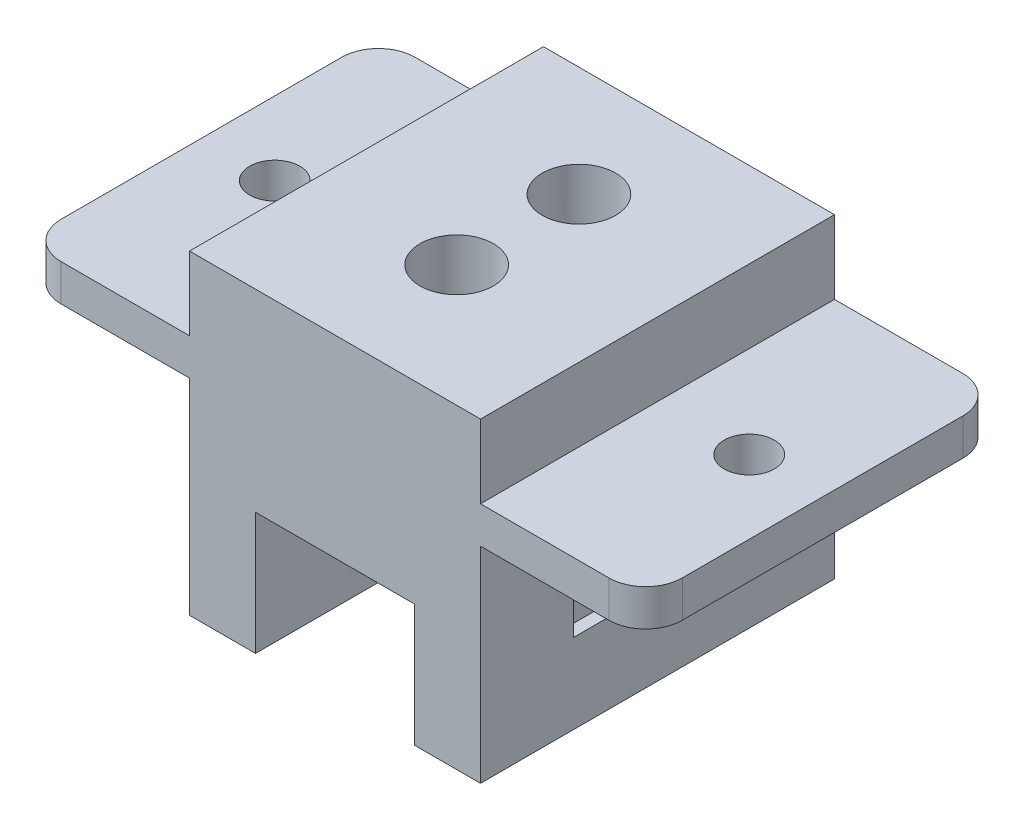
ISO-10303-21;
HEADER;
FILE_DESCRIPTION(('STEP AP214'),'2;1');
FILE_NAME('part.step','',(''),(''),'','','');
FILE_SCHEMA(('AUTOMOTIVE_DESIGN { 1 0 10303 214 1 1 1 1 }'));
ENDSEC;
DATA;
#1=APPLICATION_CONTEXT('core data for automotive mechanical design processes');
#2=APPLICATION_PROTOCOL_DEFINITION('international standard','automotive_design',2000,#1);
#3=PRODUCT_CONTEXT('',#1,'mechanical');
#4=PRODUCT('Part','Part','',(#3));
#5=PRODUCT_RELATED_PRODUCT_CATEGORY('part','',(#4));
#6=PRODUCT_DEFINITION_FORMATION('','',#4);
#7=PRODUCT_DEFINITION_CONTEXT('part definition',#1,'design');
#8=PRODUCT_DEFINITION('design','',#6,#7);
#9=PRODUCT_DEFINITION_SHAPE('','',#8);
#10=(LENGTH_UNIT() NAMED_UNIT(*) SI_UNIT(.MILLI.,.METRE.));
#11=(NAMED_UNIT(*) PLANE_ANGLE_UNIT() SI_UNIT($,.RADIAN.));
#12=(NAMED_UNIT(*) SI_UNIT($,.STERADIAN.) SOLID_ANGLE_UNIT());
#13=UNCERTAINTY_MEASURE_WITH_UNIT(LENGTH_MEASURE(1.E-05),#10,'distance_accuracy_value','');
#14=(GEOMETRIC_REPRESENTATION_CONTEXT(3) GLOBAL_UNCERTAINTY_ASSIGNED_CONTEXT((#13)) GLOBAL_UNIT_ASSIGNED_CONTEXT((#10,
#11,#12)) REPRESENTATION_CONTEXT('',''));
#15=CARTESIAN_POINT('',(0.,0.,0.));
#16=DIRECTION('',(0.,0.,1.));
#17=DIRECTION('',(1.,0.,0.));
#18=AXIS2_PLACEMENT_3D('',#15,#16,#17);
#19=CARTESIAN_POINT('',(23.8,25.8,28.95));
#20=DIRECTION('',(1.,0.,0.));
#21=DIRECTION('',(0.,0.,-1.));
#22=AXIS2_PLACEMENT_3D('',#19,#20,#21);
#23=PLANE('',#22);
#24=DIRECTION('',(0.,-1.,0.));
#25=VECTOR('',#24,1.);
#26=CARTESIAN_POINT('',(23.8,25.8,0.));
#27=LINE('',#26,#25);
#28=CARTESIAN_POINT('',(23.8,16.8,0.));
#29=VERTEX_POINT('',#28);
#30=CARTESIAN_POINT('',(23.8,0.,0.));
#31=VERTEX_POINT('',#30);
#32=EDGE_CURVE('E522',#29,#31,#27,.T.);
#33=ORIENTED_EDGE('',*,*,#32,.F.);
#34=DIRECTION('',(0.,0.,1.));
#35=VECTOR('',#34,1.);
#36=CARTESIAN_POINT('',(23.8,16.8,0.));
#37=LINE('',#36,#35);
#38=CARTESIAN_POINT('',(23.8,16.8,28.95));
#39=VERTEX_POINT('',#38);
#40=EDGE_CURVE('E466',#29,#39,#37,.T.);
#41=ORIENTED_EDGE('',*,*,#40,.T.);
#42=DIRECTION('',(0.,-1.,0.));
#43=VECTOR('',#42,1.);
#44=CARTESIAN_POINT('',(23.8,25.8,28.95));
#45=LINE('',#44,#43);
#46=CARTESIAN_POINT('',(23.8,0.,28.95));
#47=VERTEX_POINT('',#46);
#48=EDGE_CURVE('E497',#39,#47,#45,.T.);
#49=ORIENTED_EDGE('',*,*,#48,.T.);
#50=DIRECTION('',(0.,0.,-1.));
#51=VECTOR('',#50,1.);
#52=CARTESIAN_POINT('',(23.8,0.,28.95));
#53=LINE('',#52,#51);
#54=EDGE_CURVE('E548',#47,#31,#53,.T.);
#55=ORIENTED_EDGE('',*,*,#54,.T.);
#56=EDGE_LOOP('',(#33,#41,#49,#55));
#57=FACE_BOUND('',#56,.T.);
#58=DIRECTION('',(0.,0.,1.));
#59=VECTOR('',#58,1.);
#60=CARTESIAN_POINT('',(23.8,6.53013267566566,21.3382236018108));
#61=LINE('',#60,#59);
#62=CARTESIAN_POINT('',(23.8,6.53013267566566,11.4588520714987));
#63=VERTEX_POINT('',#62);
#64=CARTESIAN_POINT('',(23.8,6.53013267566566,21.3382236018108));
#65=VERTEX_POINT('',#64);
#66=EDGE_CURVE('E301',#63,#65,#61,.T.);
#67=ORIENTED_EDGE('',*,*,#66,.T.);
#68=DIRECTION('',(0.,1.,0.));
#69=VECTOR('',#68,1.);
#70=CARTESIAN_POINT('',(23.8,6.53013267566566,21.3382236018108));
#71=LINE('',#70,#69);
#72=CARTESIAN_POINT('',(23.8,11.9688428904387,21.3382236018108));
#73=VERTEX_POINT('',#72);
#74=EDGE_CURVE('E60',#65,#73,#71,.T.);
#75=ORIENTED_EDGE('',*,*,#74,.T.);
#76=DIRECTION('',(0.,0.,-1.));
#77=VECTOR('',#76,1.);
#78=CARTESIAN_POINT('',(23.8,11.9688428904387,21.3382236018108));
#79=LINE('',#78,#77);
#80=CARTESIAN_POINT('',(23.8,11.9688428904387,11.4588520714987));
#81=VERTEX_POINT('',#80);
#82=EDGE_CURVE('E286',#73,#81,#79,.T.);
#83=ORIENTED_EDGE('',*,*,#82,.T.);
#84=DIRECTION('',(0.,1.,0.));
#85=VECTOR('',#84,1.);
#86=CARTESIAN_POINT('',(23.8,11.9688428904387,11.4588520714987));
#87=LINE('',#86,#85);
#88=CARTESIAN_POINT('',(23.8,14.6008705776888,11.4588520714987));
#89=VERTEX_POINT('',#88);
#90=EDGE_CURVE('E289',#81,#89,#87,.T.);
#91=ORIENTED_EDGE('',*,*,#90,.T.);
#92=DIRECTION('',(0.,-0.757643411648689,-0.652668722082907));
#93=VECTOR('',#92,1.);
#94=CARTESIAN_POINT('',(23.8,14.6008705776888,11.4588520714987));
#95=LINE('',#94,#93);
#96=CARTESIAN_POINT('',(23.8,9.2494877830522,6.848925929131));
#97=VERTEX_POINT('',#96);
#98=EDGE_CURVE('E309',#89,#97,#95,.T.);
#99=ORIENTED_EDGE('',*,*,#98,.T.);
#100=DIRECTION('',(0.,-0.757643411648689,0.652668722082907));
#101=VECTOR('',#100,1.);
#102=CARTESIAN_POINT('',(23.8,9.2494877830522,6.848925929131));
#103=LINE('',#102,#101);
#104=CARTESIAN_POINT('',(23.8,3.89810498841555,11.4588520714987));
#105=VERTEX_POINT('',#104);
#106=EDGE_CURVE('E306',#97,#105,#103,.T.);
#107=ORIENTED_EDGE('',*,*,#106,.T.);
#108=DIRECTION('',(0.,1.,0.));
#109=VECTOR('',#108,1.);
#110=CARTESIAN_POINT('',(23.8,3.89810498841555,11.4588520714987));
#111=LINE('',#110,#109);
#112=EDGE_CURVE('E303',#105,#63,#111,.T.);
#113=ORIENTED_EDGE('',*,*,#112,.T.);
#114=EDGE_LOOP('',(#67,#75,#83,#91,#99,#107,#113));
#115=FACE_BOUND('',#114,.T.);
#116=ADVANCED_FACE('F43',(#57,#115),#23,.T.);
#117=CARTESIAN_POINT('',(0.,0.,28.95));
#118=DIRECTION('',(-1.,0.,0.));
#119=DIRECTION('',(0.,0.,1.));
#120=AXIS2_PLACEMENT_3D('',#117,#118,#119);
#121=PLANE('',#120);
#122=DIRECTION('',(0.,1.,0.));
#123=VECTOR('',#122,1.);
#124=CARTESIAN_POINT('',(0.,6.53013267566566,21.3382236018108));
#125=LINE('',#124,#123);
#126=CARTESIAN_POINT('',(0.,6.53013267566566,21.3382236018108));
#127=VERTEX_POINT('',#126);
#128=CARTESIAN_POINT('',(0.,11.9688428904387,21.3382236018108));
#129=VERTEX_POINT('',#128);
#130=EDGE_CURVE('E68',#127,#129,#125,.T.);
#131=ORIENTED_EDGE('',*,*,#130,.F.);
#132=DIRECTION('',(0.,0.,1.));
#133=VECTOR('',#132,1.);
#134=CARTESIAN_POINT('',(0.,6.53013267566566,21.3382236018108));
#135=LINE('',#134,#133);
#136=CARTESIAN_POINT('',(0.,6.53013267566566,11.4588520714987));
#137=VERTEX_POINT('',#136);
#138=EDGE_CURVE('E329',#137,#127,#135,.T.);
#139=ORIENTED_EDGE('',*,*,#138,.F.);
#140=DIRECTION('',(0.,1.,0.));
#141=VECTOR('',#140,1.);
#142=CARTESIAN_POINT('',(0.,3.89810498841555,11.4588520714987));
#143=LINE('',#142,#141);
#144=CARTESIAN_POINT('',(0.,3.89810498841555,11.4588520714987));
#145=VERTEX_POINT('',#144);
#146=EDGE_CURVE('E361',#145,#137,#143,.T.);
#147=ORIENTED_EDGE('',*,*,#146,.F.);
#148=DIRECTION('',(0.,-0.757643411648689,0.652668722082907));
#149=VECTOR('',#148,1.);
#150=CARTESIAN_POINT('',(0.,9.2494877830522,6.848925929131));
#151=LINE('',#150,#149);
#152=CARTESIAN_POINT('',(0.,9.2494877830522,6.848925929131));
#153=VERTEX_POINT('',#152);
#154=EDGE_CURVE('E358',#153,#145,#151,.T.);
#155=ORIENTED_EDGE('',*,*,#154,.F.);
#156=DIRECTION('',(0.,-0.757643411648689,-0.652668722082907));
#157=VECTOR('',#156,1.);
#158=CARTESIAN_POINT('',(0.,14.6008705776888,11.4588520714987));
#159=LINE('',#158,#157);
#160=CARTESIAN_POINT('',(0.,14.6008705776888,11.4588520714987));
#161=VERTEX_POINT('',#160);
#162=EDGE_CURVE('E355',#161,#153,#159,.T.);
#163=ORIENTED_EDGE('',*,*,#162,.F.);
#164=DIRECTION('',(0.,1.,0.));
#165=VECTOR('',#164,1.);
#166=CARTESIAN_POINT('',(0.,11.9688428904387,11.4588520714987));
#167=LINE('',#166,#165);
#168=CARTESIAN_POINT('',(0.,11.9688428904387,11.4588520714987));
#169=VERTEX_POINT('',#168);
#170=EDGE_CURVE('E352',#169,#161,#167,.T.);
#171=ORIENTED_EDGE('',*,*,#170,.F.);
#172=DIRECTION('',(0.,0.,-1.));
#173=VECTOR('',#172,1.);
#174=CARTESIAN_POINT('',(0.,11.9688428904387,21.3382236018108));
#175=LINE('',#174,#173);
#176=EDGE_CURVE('E349',#129,#169,#175,.T.);
#177=ORIENTED_EDGE('',*,*,#176,.F.);
#178=EDGE_LOOP('',(#131,#139,#147,#155,#163,#171,#177));
#179=FACE_BOUND('',#178,.T.);
#180=DIRECTION('',(0.,1.,0.));
#181=VECTOR('',#180,1.);
#182=CARTESIAN_POINT('',(0.,0.,28.95));
#183=LINE('',#182,#181);
#184=CARTESIAN_POINT('',(0.,0.,28.95));
#185=VERTEX_POINT('',#184);
#186=CARTESIAN_POINT('',(0.,16.8,28.95));
#187=VERTEX_POINT('',#186);
#188=EDGE_CURVE('E490',#185,#187,#183,.T.);
#189=ORIENTED_EDGE('',*,*,#188,.T.);
#190=DIRECTION('',(0.,0.,-1.));
#191=VECTOR('',#190,1.);
#192=CARTESIAN_POINT('',(0.,16.8,0.));
#193=LINE('',#192,#191);
#194=CARTESIAN_POINT('',(0.,16.8,0.));
#195=VERTEX_POINT('',#194);
#196=EDGE_CURVE('E388',#187,#195,#193,.T.);
#197=ORIENTED_EDGE('',*,*,#196,.T.);
#198=DIRECTION('',(0.,1.,0.));
#199=VECTOR('',#198,1.);
#200=CARTESIAN_POINT('',(0.,0.,0.));
#201=LINE('',#200,#199);
#202=CARTESIAN_POINT('',(0.,0.,0.));
#203=VERTEX_POINT('',#202);
#204=EDGE_CURVE('E516',#203,#195,#201,.T.);
#205=ORIENTED_EDGE('',*,*,#204,.F.);
#206=DIRECTION('',(0.,0.,-1.));
#207=VECTOR('',#206,1.);
#208=CARTESIAN_POINT('',(0.,0.,28.95));
#209=LINE('',#208,#207);
#210=EDGE_CURVE('E11',#185,#203,#209,.T.);
#211=ORIENTED_EDGE('',*,*,#210,.F.);
#212=EDGE_LOOP('',(#189,#197,#205,#211));
#213=FACE_BOUND('',#212,.T.);
#214=ADVANCED_FACE('F619',(#179,#213),#121,.T.);
#215=DIRECTION('',(0.,0.,-1.));
#216=VECTOR('',#215,1.);
#217=CARTESIAN_POINT('',(0.,19.8,0.));
#218=LINE('',#217,#216);
#219=CARTESIAN_POINT('',(0.,19.8,28.95));
#220=VERTEX_POINT('',#219);
#221=CARTESIAN_POINT('',(0.,19.8,0.));
#222=VERTEX_POINT('',#221);
#223=EDGE_CURVE('E383',#220,#222,#218,.T.);
#224=ORIENTED_EDGE('',*,*,#223,.F.);
#225=CARTESIAN_POINT('',(0.,25.8,28.95));
#226=VERTEX_POINT('',#225);
#227=EDGE_CURVE('E494',#220,#226,#183,.T.);
#228=ORIENTED_EDGE('',*,*,#227,.T.);
#229=DIRECTION('',(0.,0.,-1.));
#230=VECTOR('',#229,1.);
#231=CARTESIAN_POINT('',(0.,25.8,28.95));
#232=LINE('',#231,#230);
#233=CARTESIAN_POINT('',(0.,25.8,0.));
#234=VERTEX_POINT('',#233);
#235=EDGE_CURVE('E47',#226,#234,#232,.T.);
#236=ORIENTED_EDGE('',*,*,#235,.T.);
#237=EDGE_CURVE('E489',#222,#234,#201,.T.);
#238=ORIENTED_EDGE('',*,*,#237,.F.);
#239=EDGE_LOOP('',(#224,#228,#236,#238));
#240=FACE_BOUND('',#239,.T.);
#241=ADVANCED_FACE('F45',(#240),#121,.T.);
#242=CARTESIAN_POINT('',(5.4,0.,28.95));
#243=DIRECTION('',(0.,-1.,0.));
#244=DIRECTION('',(0.,0.,-1.));
#245=AXIS2_PLACEMENT_3D('',#242,#243,#244);
#246=PLANE('',#245);
#247=DIRECTION('',(-1.,0.,0.));
#248=VECTOR('',#247,1.);
#249=CARTESIAN_POINT('',(5.4,0.,0.));
#250=LINE('',#249,#248);
#251=CARTESIAN_POINT('',(5.4,0.,0.));
#252=VERTEX_POINT('',#251);
#253=EDGE_CURVE('E538',#252,#203,#250,.T.);
#254=ORIENTED_EDGE('',*,*,#253,.F.);
#255=DIRECTION('',(0.,0.,-1.));
#256=VECTOR('',#255,1.);
#257=CARTESIAN_POINT('',(5.4,0.,28.95));
#258=LINE('',#257,#256);
#259=CARTESIAN_POINT('',(5.4,0.,28.95));
#260=VERTEX_POINT('',#259);
#261=EDGE_CURVE('E52',#260,#252,#258,.T.);
#262=ORIENTED_EDGE('',*,*,#261,.F.);
#263=DIRECTION('',(-1.,0.,0.));
#264=VECTOR('',#263,1.);
#265=CARTESIAN_POINT('',(5.4,0.,28.95));
#266=LINE('',#265,#264);
#267=EDGE_CURVE('E513',#260,#185,#266,.T.);
#268=ORIENTED_EDGE('',*,*,#267,.T.);
#269=ORIENTED_EDGE('',*,*,#210,.T.);
#270=EDGE_LOOP('',(#254,#262,#268,#269));
#271=FACE_BOUND('',#270,.T.);
#272=ADVANCED_FACE('F615',(#271),#246,.T.);
#273=CARTESIAN_POINT('',(5.4,10.,28.95));
#274=DIRECTION('',(1.,0.,0.));
#275=DIRECTION('',(0.,0.,-1.));
#276=AXIS2_PLACEMENT_3D('',#273,#274,#275);
#277=PLANE('',#276);
#278=DIRECTION('',(0.,-1.,0.));
#279=VECTOR('',#278,1.);
#280=CARTESIAN_POINT('',(5.4,10.,0.));
#281=LINE('',#280,#279);
#282=CARTESIAN_POINT('',(5.4,10.,0.));
#283=VERTEX_POINT('',#282);
#284=EDGE_CURVE('E535',#283,#252,#281,.T.);
#285=ORIENTED_EDGE('',*,*,#284,.F.);
#286=DIRECTION('',(0.,0.,-1.));
#287=VECTOR('',#286,1.);
#288=CARTESIAN_POINT('',(5.4,10.,28.95));
#289=LINE('',#288,#287);
#290=CARTESIAN_POINT('',(5.4,10.,28.95));
#291=VERTEX_POINT('',#290);
#292=EDGE_CURVE('E542',#291,#283,#289,.T.);
#293=ORIENTED_EDGE('',*,*,#292,.F.);
#294=DIRECTION('',(0.,-1.,0.));
#295=VECTOR('',#294,1.);
#296=CARTESIAN_POINT('',(5.4,10.,28.95));
#297=LINE('',#296,#295);
#298=EDGE_CURVE('E510',#291,#260,#297,.T.);
#299=ORIENTED_EDGE('',*,*,#298,.T.);
#300=ORIENTED_EDGE('',*,*,#261,.T.);
#301=EDGE_LOOP('',(#285,#293,#299,#300));
#302=FACE_BOUND('',#301,.T.);
#303=ADVANCED_FACE('F612',(#302),#277,.T.);
#304=CARTESIAN_POINT('',(18.4,10.,28.95));
#305=DIRECTION('',(0.,-1.,0.));
#306=DIRECTION('',(0.,0.,-1.));
#307=AXIS2_PLACEMENT_3D('',#304,#305,#306);
#308=PLANE('',#307);
#309=CARTESIAN_POINT('',(11.9,10.,9.));
#310=DIRECTION('',(0.,-1.,0.));
#311=DIRECTION('',(0.,0.,-1.));
#312=AXIS2_PLACEMENT_3D('',#309,#310,#311);
#313=CIRCLE('',#312,3.);
#314=CARTESIAN_POINT('',(11.9,10.,6.));
#315=VERTEX_POINT('',#314);
#316=EDGE_CURVE('E486',#315,#315,#313,.T.);
#317=ORIENTED_EDGE('',*,*,#316,.F.);
#318=EDGE_LOOP('',(#317));
#319=FACE_BOUND('',#318,.T.);
#320=CARTESIAN_POINT('',(11.9,10.,19.));
#321=DIRECTION('',(0.,-1.,0.));
#322=DIRECTION('',(0.,0.,-1.));
#323=AXIS2_PLACEMENT_3D('',#320,#321,#322);
#324=CIRCLE('',#323,3.);
#325=CARTESIAN_POINT('',(11.9,10.,16.));
#326=VERTEX_POINT('',#325);
#327=EDGE_CURVE('E481',#326,#326,#324,.T.);
#328=ORIENTED_EDGE('',*,*,#327,.F.);
#329=EDGE_LOOP('',(#328));
#330=FACE_BOUND('',#329,.T.);
#331=DIRECTION('',(-1.,0.,0.));
#332=VECTOR('',#331,1.);
#333=CARTESIAN_POINT('',(18.4,10.,0.));
#334=LINE('',#333,#332);
#335=CARTESIAN_POINT('',(18.4,10.,0.));
#336=VERTEX_POINT('',#335);
#337=EDGE_CURVE('E532',#336,#283,#334,.T.);
#338=ORIENTED_EDGE('',*,*,#337,.F.);
#339=DIRECTION('',(0.,0.,-1.));
#340=VECTOR('',#339,1.);
#341=CARTESIAN_POINT('',(18.4,10.,28.95));
#342=LINE('',#341,#340);
#343=CARTESIAN_POINT('',(18.4,10.,28.95));
#344=VERTEX_POINT('',#343);
#345=EDGE_CURVE('E544',#344,#336,#342,.T.);
#346=ORIENTED_EDGE('',*,*,#345,.F.);
#347=DIRECTION('',(-1.,0.,0.));
#348=VECTOR('',#347,1.);
#349=CARTESIAN_POINT('',(18.4,10.,28.95));
#350=LINE('',#349,#348);
#351=EDGE_CURVE('E507',#344,#291,#350,.T.);
#352=ORIENTED_EDGE('',*,*,#351,.T.);
#353=ORIENTED_EDGE('',*,*,#292,.T.);
#354=EDGE_LOOP('',(#338,#346,#352,#353));
#355=FACE_BOUND('',#354,.T.);
#356=ADVANCED_FACE('F608',(#319,#330,#355),#308,.T.);
#357=CARTESIAN_POINT('',(18.4,0.,28.95));
#358=DIRECTION('',(-1.,0.,0.));
#359=DIRECTION('',(0.,0.,1.));
#360=AXIS2_PLACEMENT_3D('',#357,#358,#359);
#361=PLANE('',#360);
#362=DIRECTION('',(0.,1.,0.));
#363=VECTOR('',#362,1.);
#364=CARTESIAN_POINT('',(18.4,0.,0.));
#365=LINE('',#364,#363);
#366=CARTESIAN_POINT('',(18.4,0.,0.));
#367=VERTEX_POINT('',#366);
#368=EDGE_CURVE('E529',#367,#336,#365,.T.);
#369=ORIENTED_EDGE('',*,*,#368,.F.);
#370=DIRECTION('',(0.,0.,-1.));
#371=VECTOR('',#370,1.);
#372=CARTESIAN_POINT('',(18.4,0.,28.95));
#373=LINE('',#372,#371);
#374=CARTESIAN_POINT('',(18.4,0.,28.95));
#375=VERTEX_POINT('',#374);
#376=EDGE_CURVE('E546',#375,#367,#373,.T.);
#377=ORIENTED_EDGE('',*,*,#376,.F.);
#378=DIRECTION('',(0.,1.,0.));
#379=VECTOR('',#378,1.);
#380=CARTESIAN_POINT('',(18.4,0.,28.95));
#381=LINE('',#380,#379);
#382=EDGE_CURVE('E504',#375,#344,#381,.T.);
#383=ORIENTED_EDGE('',*,*,#382,.T.);
#384=ORIENTED_EDGE('',*,*,#345,.T.);
#385=EDGE_LOOP('',(#369,#377,#383,#384));
#386=FACE_BOUND('',#385,.T.);
#387=ADVANCED_FACE('F605',(#386),#361,.T.);
#388=CARTESIAN_POINT('',(23.8,0.,28.95));
#389=DIRECTION('',(0.,-1.,0.));
#390=DIRECTION('',(0.,0.,-1.));
#391=AXIS2_PLACEMENT_3D('',#388,#389,#390);
#392=PLANE('',#391);
#393=DIRECTION('',(-1.,0.,0.));
#394=VECTOR('',#393,1.);
#395=CARTESIAN_POINT('',(23.8,0.,0.));
#396=LINE('',#395,#394);
#397=EDGE_CURVE('E526',#31,#367,#396,.T.);
#398=ORIENTED_EDGE('',*,*,#397,.F.);
#399=ORIENTED_EDGE('',*,*,#54,.F.);
#400=DIRECTION('',(-1.,0.,0.));
#401=VECTOR('',#400,1.);
#402=CARTESIAN_POINT('',(23.8,0.,28.95));
#403=LINE('',#402,#401);
#404=EDGE_CURVE('E501',#47,#375,#403,.T.);
#405=ORIENTED_EDGE('',*,*,#404,.T.);
#406=ORIENTED_EDGE('',*,*,#376,.T.);
#407=EDGE_LOOP('',(#398,#399,#405,#406));
#408=FACE_BOUND('',#407,.T.);
#409=ADVANCED_FACE('F601',(#408),#392,.T.);
#410=DIRECTION('',(0.,0.,1.));
#411=VECTOR('',#410,1.);
#412=CARTESIAN_POINT('',(23.8,19.8,0.));
#413=LINE('',#412,#411);
#414=CARTESIAN_POINT('',(23.8,19.8,0.));
#415=VERTEX_POINT('',#414);
#416=CARTESIAN_POINT('',(23.8,19.8,28.95));
#417=VERTEX_POINT('',#416);
#418=EDGE_CURVE('E449',#415,#417,#413,.T.);
#419=ORIENTED_EDGE('',*,*,#418,.F.);
#420=CARTESIAN_POINT('',(23.8,25.8,0.));
#421=VERTEX_POINT('',#420);
#422=EDGE_CURVE('E523',#421,#415,#27,.T.);
#423=ORIENTED_EDGE('',*,*,#422,.F.);
#424=DIRECTION('',(0.,0.,-1.));
#425=VECTOR('',#424,1.);
#426=CARTESIAN_POINT('',(23.8,25.8,28.95));
#427=LINE('',#426,#425);
#428=CARTESIAN_POINT('',(23.8,25.8,28.95));
#429=VERTEX_POINT('',#428);
#430=EDGE_CURVE('E550',#429,#421,#427,.T.);
#431=ORIENTED_EDGE('',*,*,#430,.F.);
#432=EDGE_CURVE('E498',#429,#417,#45,.T.);
#433=ORIENTED_EDGE('',*,*,#432,.T.);
#434=EDGE_LOOP('',(#419,#423,#431,#433));
#435=FACE_BOUND('',#434,.T.);
#436=ADVANCED_FACE('F575',(#435),#23,.T.);
#437=CARTESIAN_POINT('',(0.,25.8,28.95));
#438=DIRECTION('',(0.,1.,0.));
#439=DIRECTION('',(-1.,0.,0.));
#440=AXIS2_PLACEMENT_3D('',#437,#438,#439);
#441=PLANE('',#440);
#442=CARTESIAN_POINT('',(11.9,25.8,9.));
#443=DIRECTION('',(0.,1.,0.));
#444=DIRECTION('',(0.,0.,1.));
#445=AXIS2_PLACEMENT_3D('',#442,#443,#444);
#446=CIRCLE('',#445,3.);
#447=CARTESIAN_POINT('',(11.9,25.8,12.));
#448=VERTEX_POINT('',#447);
#449=EDGE_CURVE('E478',#448,#448,#446,.T.);
#450=ORIENTED_EDGE('',*,*,#449,.F.);
#451=EDGE_LOOP('',(#450));
#452=FACE_BOUND('',#451,.T.);
#453=CARTESIAN_POINT('',(11.9,25.8,19.));
#454=DIRECTION('',(0.,1.,0.));
#455=DIRECTION('',(0.,0.,1.));
#456=AXIS2_PLACEMENT_3D('',#453,#454,#455);
#457=CIRCLE('',#456,3.);
#458=CARTESIAN_POINT('',(11.9,25.8,22.));
#459=VERTEX_POINT('',#458);
#460=EDGE_CURVE('E425',#459,#459,#457,.T.);
#461=ORIENTED_EDGE('',*,*,#460,.F.);
#462=EDGE_LOOP('',(#461));
#463=FACE_BOUND('',#462,.T.);
#464=DIRECTION('',(1.,0.,0.));
#465=VECTOR('',#464,1.);
#466=CARTESIAN_POINT('',(0.,25.8,0.));
#467=LINE('',#466,#465);
#468=EDGE_CURVE('E519',#234,#421,#467,.T.);
#469=ORIENTED_EDGE('',*,*,#468,.F.);
#470=ORIENTED_EDGE('',*,*,#235,.F.);
#471=DIRECTION('',(1.,0.,0.));
#472=VECTOR('',#471,1.);
#473=CARTESIAN_POINT('',(0.,25.8,28.95));
#474=LINE('',#473,#472);
#475=EDGE_CURVE('E493',#226,#429,#474,.T.);
#476=ORIENTED_EDGE('',*,*,#475,.T.);
#477=ORIENTED_EDGE('',*,*,#430,.T.);
#478=EDGE_LOOP('',(#469,#470,#476,#477));
#479=FACE_BOUND('',#478,.T.);
#480=ADVANCED_FACE('F561',(#452,#463,#479),#441,.T.);
#481=CARTESIAN_POINT('',(0.,0.,28.95));
#482=DIRECTION('',(0.,0.,-1.));
#483=DIRECTION('',(-1.,0.,0.));
#484=AXIS2_PLACEMENT_3D('',#481,#482,#483);
#485=PLANE('',#484);
#486=ORIENTED_EDGE('',*,*,#188,.F.);
#487=ORIENTED_EDGE('',*,*,#267,.F.);
#488=ORIENTED_EDGE('',*,*,#298,.F.);
#489=ORIENTED_EDGE('',*,*,#351,.F.);
#490=ORIENTED_EDGE('',*,*,#382,.F.);
#491=ORIENTED_EDGE('',*,*,#404,.F.);
#492=ORIENTED_EDGE('',*,*,#48,.F.);
#493=DIRECTION('',(1.,0.,0.));
#494=VECTOR('',#493,1.);
#495=CARTESIAN_POINT('',(34.3,16.8,28.95));
#496=LINE('',#495,#494);
#497=CARTESIAN_POINT('',(34.3,16.8,28.95));
#498=VERTEX_POINT('',#497);
#499=EDGE_CURVE('E463',#39,#498,#496,.T.);
#500=ORIENTED_EDGE('',*,*,#499,.T.);
#501=DIRECTION('',(0.,1.,0.));
#502=VECTOR('',#501,1.);
#503=CARTESIAN_POINT('',(34.3,16.8,28.95));
#504=LINE('',#503,#502);
#505=CARTESIAN_POINT('',(34.3,19.8,28.95));
#506=VERTEX_POINT('',#505);
#507=EDGE_CURVE('E434',#498,#506,#504,.T.);
#508=ORIENTED_EDGE('',*,*,#507,.T.);
#509=DIRECTION('',(1.,0.,0.));
#510=VECTOR('',#509,1.);
#511=CARTESIAN_POINT('',(34.3,19.8,28.95));
#512=LINE('',#511,#510);
#513=EDGE_CURVE('E446',#417,#506,#512,.T.);
#514=ORIENTED_EDGE('',*,*,#513,.F.);
#515=ORIENTED_EDGE('',*,*,#432,.F.);
#516=ORIENTED_EDGE('',*,*,#475,.F.);
#517=ORIENTED_EDGE('',*,*,#227,.F.);
#518=DIRECTION('',(1.,0.,0.));
#519=VECTOR('',#518,1.);
#520=CARTESIAN_POINT('',(-10.5,19.8,28.95));
#521=LINE('',#520,#519);
#522=CARTESIAN_POINT('',(-10.5,19.8,28.95));
#523=VERTEX_POINT('',#522);
#524=EDGE_CURVE('E392',#523,#220,#521,.T.);
#525=ORIENTED_EDGE('',*,*,#524,.F.);
#526=DIRECTION('',(0.,1.,0.));
#527=VECTOR('',#526,1.);
#528=CARTESIAN_POINT('',(-10.5,16.8,28.95));
#529=LINE('',#528,#527);
#530=CARTESIAN_POINT('',(-10.5,16.8,28.95));
#531=VERTEX_POINT('',#530);
#532=EDGE_CURVE('E423',#531,#523,#529,.T.);
#533=ORIENTED_EDGE('',*,*,#532,.F.);
#534=DIRECTION('',(1.,0.,0.));
#535=VECTOR('',#534,1.);
#536=CARTESIAN_POINT('',(-10.5,16.8,28.95));
#537=LINE('',#536,#535);
#538=EDGE_CURVE('E404',#531,#187,#537,.T.);
#539=ORIENTED_EDGE('',*,*,#538,.T.);
#540=EDGE_LOOP('',(#486,#487,#488,#489,#490,#491,#492,#500,#508,#514,#515,#516,#517,#525,#533,#539));
#541=FACE_BOUND('',#540,.T.);
#542=ADVANCED_FACE('F571',(#541),#485,.F.);
#543=CARTESIAN_POINT('',(0.,0.,0.));
#544=DIRECTION('',(0.,0.,-1.));
#545=DIRECTION('',(-1.,0.,0.));
#546=AXIS2_PLACEMENT_3D('',#543,#544,#545);
#547=PLANE('',#546);
#548=ORIENTED_EDGE('',*,*,#204,.T.);
#549=DIRECTION('',(-1.,0.,0.));
#550=VECTOR('',#549,1.);
#551=CARTESIAN_POINT('',(0.,16.8,0.));
#552=LINE('',#551,#550);
#553=CARTESIAN_POINT('',(-10.5,16.8,0.));
#554=VERTEX_POINT('',#553);
#555=EDGE_CURVE('E391',#195,#554,#552,.T.);
#556=ORIENTED_EDGE('',*,*,#555,.T.);
#557=DIRECTION('',(0.,1.,0.));
#558=VECTOR('',#557,1.);
#559=CARTESIAN_POINT('',(-10.5,16.8,0.));
#560=LINE('',#559,#558);
#561=CARTESIAN_POINT('',(-10.5,19.8,0.));
#562=VERTEX_POINT('',#561);
#563=EDGE_CURVE('E407',#554,#562,#560,.T.);
#564=ORIENTED_EDGE('',*,*,#563,.T.);
#565=DIRECTION('',(-1.,0.,0.));
#566=VECTOR('',#565,1.);
#567=CARTESIAN_POINT('',(0.,19.8,0.));
#568=LINE('',#567,#566);
#569=EDGE_CURVE('E410',#222,#562,#568,.T.);
#570=ORIENTED_EDGE('',*,*,#569,.F.);
#571=ORIENTED_EDGE('',*,*,#237,.T.);
#572=ORIENTED_EDGE('',*,*,#468,.T.);
#573=ORIENTED_EDGE('',*,*,#422,.T.);
#574=DIRECTION('',(-1.,0.,0.));
#575=VECTOR('',#574,1.);
#576=CARTESIAN_POINT('',(23.8,19.8,0.));
#577=LINE('',#576,#575);
#578=CARTESIAN_POINT('',(34.3,19.8,0.));
#579=VERTEX_POINT('',#578);
#580=EDGE_CURVE('E452',#579,#415,#577,.T.);
#581=ORIENTED_EDGE('',*,*,#580,.F.);
#582=DIRECTION('',(0.,1.,0.));
#583=VECTOR('',#582,1.);
#584=CARTESIAN_POINT('',(34.3,16.8,0.));
#585=LINE('',#584,#583);
#586=CARTESIAN_POINT('',(34.3,16.8,0.));
#587=VERTEX_POINT('',#586);
#588=EDGE_CURVE('E431',#587,#579,#585,.T.);
#589=ORIENTED_EDGE('',*,*,#588,.F.);
#590=DIRECTION('',(-1.,0.,0.));
#591=VECTOR('',#590,1.);
#592=CARTESIAN_POINT('',(23.8,16.8,0.));
#593=LINE('',#592,#591);
#594=EDGE_CURVE('E469',#587,#29,#593,.T.);
#595=ORIENTED_EDGE('',*,*,#594,.T.);
#596=ORIENTED_EDGE('',*,*,#32,.T.);
#597=ORIENTED_EDGE('',*,*,#397,.T.);
#598=ORIENTED_EDGE('',*,*,#368,.T.);
#599=ORIENTED_EDGE('',*,*,#337,.T.);
#600=ORIENTED_EDGE('',*,*,#284,.T.);
#601=ORIENTED_EDGE('',*,*,#253,.T.);
#602=EDGE_LOOP('',(#548,#556,#564,#570,#571,#572,#573,#581,#589,#595,#596,#597,#598,#599,#600,#601));
#603=FACE_BOUND('',#602,.T.);
#604=ADVANCED_FACE('F563',(#603),#547,.T.);
#605=CARTESIAN_POINT('',(11.9,-2.2,19.));
#606=DIRECTION('',(0.,1.,0.));
#607=DIRECTION('',(0.,0.,1.));
#608=AXIS2_PLACEMENT_3D('',#605,#606,#607);
#609=CYLINDRICAL_SURFACE('',#608,3.);
#610=ORIENTED_EDGE('',*,*,#327,.T.);
#611=EDGE_LOOP('',(#610));
#612=FACE_BOUND('',#611,.T.);
#613=ORIENTED_EDGE('',*,*,#460,.T.);
#614=EDGE_LOOP('',(#613));
#615=FACE_BOUND('',#614,.T.);
#616=ADVANCED_FACE('F676',(#612,#615),#609,.F.);
#617=CARTESIAN_POINT('',(11.9,-2.2,9.));
#618=DIRECTION('',(0.,1.,0.));
#619=DIRECTION('',(0.,0.,1.));
#620=AXIS2_PLACEMENT_3D('',#617,#618,#619);
#621=CYLINDRICAL_SURFACE('',#620,3.);
#622=ORIENTED_EDGE('',*,*,#316,.T.);
#623=EDGE_LOOP('',(#622));
#624=FACE_BOUND('',#623,.T.);
#625=ORIENTED_EDGE('',*,*,#449,.T.);
#626=EDGE_LOOP('',(#625));
#627=FACE_BOUND('',#626,.T.);
#628=ADVANCED_FACE('F680',(#624,#627),#621,.F.);
#629=CARTESIAN_POINT('',(34.3,16.8,3.00000000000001));
#630=DIRECTION('',(0.,1.,0.));
#631=DIRECTION('',(0.,0.,1.));
#632=AXIS2_PLACEMENT_3D('',#629,#630,#631);
#633=CYLINDRICAL_SURFACE('',#632,3.);
#634=CARTESIAN_POINT('',(34.3,19.8,3.00000000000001));
#635=DIRECTION('',(0.,1.,0.));
#636=DIRECTION('',(0.,0.,-1.));
#637=AXIS2_PLACEMENT_3D('',#634,#635,#636);
#638=CIRCLE('',#637,3.);
#639=CARTESIAN_POINT('',(37.3,19.8,3.00000000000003));
#640=VERTEX_POINT('',#639);
#641=EDGE_CURVE('E454',#640,#579,#638,.T.);
#642=ORIENTED_EDGE('',*,*,#641,.F.);
#643=DIRECTION('',(0.,1.,0.));
#644=VECTOR('',#643,1.);
#645=CARTESIAN_POINT('',(37.3,16.8,3.00000000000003));
#646=LINE('',#645,#644);
#647=CARTESIAN_POINT('',(37.3,16.8,3.00000000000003));
#648=VERTEX_POINT('',#647);
#649=EDGE_CURVE('E368',#648,#640,#646,.T.);
#650=ORIENTED_EDGE('',*,*,#649,.F.);
#651=CARTESIAN_POINT('',(34.3,16.8,3.00000000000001));
#652=DIRECTION('',(0.,1.,0.));
#653=DIRECTION('',(0.,0.,-1.));
#654=AXIS2_PLACEMENT_3D('',#651,#652,#653);
#655=CIRCLE('',#654,3.);
#656=EDGE_CURVE('E443',#648,#587,#655,.T.);
#657=ORIENTED_EDGE('',*,*,#656,.T.);
#658=ORIENTED_EDGE('',*,*,#588,.T.);
#659=EDGE_LOOP('',(#642,#650,#657,#658));
#660=FACE_BOUND('',#659,.T.);
#661=ADVANCED_FACE('F586',(#660),#633,.T.);
#662=CARTESIAN_POINT('',(37.3,16.8,3.00000000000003));
#663=DIRECTION('',(1.,0.,0.));
#664=DIRECTION('',(0.,0.,-1.));
#665=AXIS2_PLACEMENT_3D('',#662,#663,#664);
#666=PLANE('',#665);
#667=DIRECTION('',(0.,0.,-1.));
#668=VECTOR('',#667,1.);
#669=CARTESIAN_POINT('',(37.3,19.8,3.00000000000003));
#670=LINE('',#669,#668);
#671=CARTESIAN_POINT('',(37.3,19.8,25.95));
#672=VERTEX_POINT('',#671);
#673=EDGE_CURVE('E439',#672,#640,#670,.T.);
#674=ORIENTED_EDGE('',*,*,#673,.F.);
#675=DIRECTION('',(0.,1.,0.));
#676=VECTOR('',#675,1.);
#677=CARTESIAN_POINT('',(37.3,16.8,25.95));
#678=LINE('',#677,#676);
#679=CARTESIAN_POINT('',(37.3,16.8,25.95));
#680=VERTEX_POINT('',#679);
#681=EDGE_CURVE('E436',#680,#672,#678,.T.);
#682=ORIENTED_EDGE('',*,*,#681,.F.);
#683=DIRECTION('',(0.,0.,-1.));
#684=VECTOR('',#683,1.);
#685=CARTESIAN_POINT('',(37.3,16.8,3.00000000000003));
#686=LINE('',#685,#684);
#687=EDGE_CURVE('E433',#680,#648,#686,.T.);
#688=ORIENTED_EDGE('',*,*,#687,.T.);
#689=ORIENTED_EDGE('',*,*,#649,.T.);
#690=EDGE_LOOP('',(#674,#682,#688,#689));
#691=FACE_BOUND('',#690,.T.);
#692=ADVANCED_FACE('F589',(#691),#666,.T.);
#693=CARTESIAN_POINT('',(34.3,16.8,25.95));
#694=DIRECTION('',(0.,1.,0.));
#695=DIRECTION('',(0.,0.,1.));
#696=AXIS2_PLACEMENT_3D('',#693,#694,#695);
#697=CYLINDRICAL_SURFACE('',#696,3.);
#698=CARTESIAN_POINT('',(34.3,19.8,25.95));
#699=DIRECTION('',(0.,1.,0.));
#700=DIRECTION('',(0.,0.,-1.));
#701=AXIS2_PLACEMENT_3D('',#698,#699,#700);
#702=CIRCLE('',#701,3.);
#703=EDGE_CURVE('E442',#506,#672,#702,.T.);
#704=ORIENTED_EDGE('',*,*,#703,.F.);
#705=ORIENTED_EDGE('',*,*,#507,.F.);
#706=CARTESIAN_POINT('',(34.3,16.8,25.95));
#707=DIRECTION('',(0.,1.,0.));
#708=DIRECTION('',(0.,0.,-1.));
#709=AXIS2_PLACEMENT_3D('',#706,#707,#708);
#710=CIRCLE('',#709,3.);
#711=EDGE_CURVE('E460',#498,#680,#710,.T.);
#712=ORIENTED_EDGE('',*,*,#711,.T.);
#713=ORIENTED_EDGE('',*,*,#681,.T.);
#714=EDGE_LOOP('',(#704,#705,#712,#713));
#715=FACE_BOUND('',#714,.T.);
#716=ADVANCED_FACE('F687',(#715),#697,.T.);
#717=CARTESIAN_POINT('',(34.3,16.8,3.00000000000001));
#718=DIRECTION('',(0.,-1.,0.));
#719=DIRECTION('',(0.,0.,-1.));
#720=AXIS2_PLACEMENT_3D('',#717,#718,#719);
#721=PLANE('',#720);
#722=CARTESIAN_POINT('',(31.3,16.8,14.475));
#723=DIRECTION('',(0.,1.,0.));
#724=DIRECTION('',(0.,0.,-1.));
#725=AXIS2_PLACEMENT_3D('',#722,#723,#724);
#726=CIRCLE('',#725,2.05);
#727=CARTESIAN_POINT('',(31.3,16.8,12.425));
#728=VERTEX_POINT('',#727);
#729=EDGE_CURVE('E457',#728,#728,#726,.T.);
#730=ORIENTED_EDGE('',*,*,#729,.T.);
#731=EDGE_LOOP('',(#730));
#732=FACE_BOUND('',#731,.T.);
#733=ORIENTED_EDGE('',*,*,#656,.F.);
#734=ORIENTED_EDGE('',*,*,#687,.F.);
#735=ORIENTED_EDGE('',*,*,#711,.F.);
#736=ORIENTED_EDGE('',*,*,#499,.F.);
#737=ORIENTED_EDGE('',*,*,#40,.F.);
#738=ORIENTED_EDGE('',*,*,#594,.F.);
#739=EDGE_LOOP('',(#733,#734,#735,#736,#737,#738));
#740=FACE_BOUND('',#739,.T.);
#741=ADVANCED_FACE('F584',(#732,#740),#721,.T.);
#742=CARTESIAN_POINT('',(34.3,19.8,3.00000000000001));
#743=DIRECTION('',(0.,-1.,0.));
#744=DIRECTION('',(0.,0.,-1.));
#745=AXIS2_PLACEMENT_3D('',#742,#743,#744);
#746=PLANE('',#745);
#747=CARTESIAN_POINT('',(31.3,19.8,14.475));
#748=DIRECTION('',(0.,1.,0.));
#749=DIRECTION('',(0.,0.,-1.));
#750=AXIS2_PLACEMENT_3D('',#747,#748,#749);
#751=CIRCLE('',#750,2.05);
#752=CARTESIAN_POINT('',(31.3,19.8,12.425));
#753=VERTEX_POINT('',#752);
#754=EDGE_CURVE('E387',#753,#753,#751,.T.);
#755=ORIENTED_EDGE('',*,*,#754,.F.);
#756=EDGE_LOOP('',(#755));
#757=FACE_BOUND('',#756,.T.);
#758=ORIENTED_EDGE('',*,*,#641,.T.);
#759=ORIENTED_EDGE('',*,*,#580,.T.);
#760=ORIENTED_EDGE('',*,*,#418,.T.);
#761=ORIENTED_EDGE('',*,*,#513,.T.);
#762=ORIENTED_EDGE('',*,*,#703,.T.);
#763=ORIENTED_EDGE('',*,*,#673,.T.);
#764=EDGE_LOOP('',(#758,#759,#760,#761,#762,#763));
#765=FACE_BOUND('',#764,.T.);
#766=ADVANCED_FACE('F577',(#757,#765),#746,.F.);
#767=CARTESIAN_POINT('',(31.3,16.8,14.475));
#768=DIRECTION('',(0.,1.,0.));
#769=DIRECTION('',(0.,0.,1.));
#770=AXIS2_PLACEMENT_3D('',#767,#768,#769);
#771=CYLINDRICAL_SURFACE('',#770,2.05);
#772=ORIENTED_EDGE('',*,*,#729,.F.);
#773=EDGE_LOOP('',(#772));
#774=FACE_BOUND('',#773,.T.);
#775=ORIENTED_EDGE('',*,*,#754,.T.);
#776=EDGE_LOOP('',(#775));
#777=FACE_BOUND('',#776,.T.);
#778=ADVANCED_FACE('F635',(#774,#777),#771,.F.);
#779=CARTESIAN_POINT('',(-10.5,16.8,25.95));
#780=DIRECTION('',(0.,1.,0.));
#781=DIRECTION('',(0.,0.,1.));
#782=AXIS2_PLACEMENT_3D('',#779,#780,#781);
#783=CYLINDRICAL_SURFACE('',#782,3.);
#784=CARTESIAN_POINT('',(-10.5,19.8,25.95));
#785=DIRECTION('',(0.,1.,0.));
#786=DIRECTION('',(0.,0.,1.));
#787=AXIS2_PLACEMENT_3D('',#784,#785,#786);
#788=CIRCLE('',#787,3.);
#789=CARTESIAN_POINT('',(-13.5,19.8,25.95));
#790=VERTEX_POINT('',#789);
#791=EDGE_CURVE('E419',#790,#523,#788,.T.);
#792=ORIENTED_EDGE('',*,*,#791,.F.);
#793=DIRECTION('',(0.,1.,0.));
#794=VECTOR('',#793,1.);
#795=CARTESIAN_POINT('',(-13.5,16.8,25.95));
#796=LINE('',#795,#794);
#797=CARTESIAN_POINT('',(-13.5,16.8,25.95));
#798=VERTEX_POINT('',#797);
#799=EDGE_CURVE('E426',#798,#790,#796,.T.);
#800=ORIENTED_EDGE('',*,*,#799,.F.);
#801=CARTESIAN_POINT('',(-10.5,16.8,25.95));
#802=DIRECTION('',(0.,1.,0.));
#803=DIRECTION('',(0.,0.,1.));
#804=AXIS2_PLACEMENT_3D('',#801,#802,#803);
#805=CIRCLE('',#804,3.);
#806=EDGE_CURVE('E401',#798,#531,#805,.T.);
#807=ORIENTED_EDGE('',*,*,#806,.T.);
#808=ORIENTED_EDGE('',*,*,#532,.T.);
#809=EDGE_LOOP('',(#792,#800,#807,#808));
#810=FACE_BOUND('',#809,.T.);
#811=ADVANCED_FACE('F633',(#810),#783,.T.);
#812=CARTESIAN_POINT('',(-13.5,16.8,3.00000000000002));
#813=DIRECTION('',(-1.,0.,0.));
#814=DIRECTION('',(0.,0.,1.));
#815=AXIS2_PLACEMENT_3D('',#812,#813,#814);
#816=PLANE('',#815);
#817=DIRECTION('',(0.,0.,1.));
#818=VECTOR('',#817,1.);
#819=CARTESIAN_POINT('',(-13.5,19.8,3.00000000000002));
#820=LINE('',#819,#818);
#821=CARTESIAN_POINT('',(-13.5,19.8,3.00000000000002));
#822=VERTEX_POINT('',#821);
#823=EDGE_CURVE('E416',#822,#790,#820,.T.);
#824=ORIENTED_EDGE('',*,*,#823,.F.);
#825=DIRECTION('',(0.,1.,0.));
#826=VECTOR('',#825,1.);
#827=CARTESIAN_POINT('',(-13.5,16.8,3.00000000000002));
#828=LINE('',#827,#826);
#829=CARTESIAN_POINT('',(-13.5,16.8,3.00000000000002));
#830=VERTEX_POINT('',#829);
#831=EDGE_CURVE('E428',#830,#822,#828,.T.);
#832=ORIENTED_EDGE('',*,*,#831,.F.);
#833=DIRECTION('',(0.,0.,1.));
#834=VECTOR('',#833,1.);
#835=CARTESIAN_POINT('',(-13.5,16.8,3.00000000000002));
#836=LINE('',#835,#834);
#837=EDGE_CURVE('E398',#830,#798,#836,.T.);
#838=ORIENTED_EDGE('',*,*,#837,.T.);
#839=ORIENTED_EDGE('',*,*,#799,.T.);
#840=EDGE_LOOP('',(#824,#832,#838,#839));
#841=FACE_BOUND('',#840,.T.);
#842=ADVANCED_FACE('F631',(#841),#816,.T.);
#843=CARTESIAN_POINT('',(-10.5,16.8,3.));
#844=DIRECTION('',(0.,1.,0.));
#845=DIRECTION('',(0.,0.,1.));
#846=AXIS2_PLACEMENT_3D('',#843,#844,#845);
#847=CYLINDRICAL_SURFACE('',#846,3.);
#848=CARTESIAN_POINT('',(-10.5,19.8,3.));
#849=DIRECTION('',(0.,1.,0.));
#850=DIRECTION('',(0.,0.,1.));
#851=AXIS2_PLACEMENT_3D('',#848,#849,#850);
#852=CIRCLE('',#851,3.);
#853=EDGE_CURVE('E413',#562,#822,#852,.T.);
#854=ORIENTED_EDGE('',*,*,#853,.F.);
#855=ORIENTED_EDGE('',*,*,#563,.F.);
#856=CARTESIAN_POINT('',(-10.5,16.8,3.));
#857=DIRECTION('',(0.,1.,0.));
#858=DIRECTION('',(0.,0.,1.));
#859=AXIS2_PLACEMENT_3D('',#856,#857,#858);
#860=CIRCLE('',#859,3.);
#861=EDGE_CURVE('E395',#554,#830,#860,.T.);
#862=ORIENTED_EDGE('',*,*,#861,.T.);
#863=ORIENTED_EDGE('',*,*,#831,.T.);
#864=EDGE_LOOP('',(#854,#855,#862,#863));
#865=FACE_BOUND('',#864,.T.);
#866=ADVANCED_FACE('F627',(#865),#847,.T.);
#867=CARTESIAN_POINT('',(-10.5,16.8,25.95));
#868=DIRECTION('',(0.,1.,0.));
#869=DIRECTION('',(0.,0.,1.));
#870=AXIS2_PLACEMENT_3D('',#867,#868,#869);
#871=PLANE('',#870);
#872=CARTESIAN_POINT('',(-7.5,16.8,14.475));
#873=DIRECTION('',(0.,1.,0.));
#874=DIRECTION('',(0.,0.,1.));
#875=AXIS2_PLACEMENT_3D('',#872,#873,#874);
#876=CIRCLE('',#875,2.05);
#877=CARTESIAN_POINT('',(-7.5,16.8,16.525));
#878=VERTEX_POINT('',#877);
#879=EDGE_CURVE('E380',#878,#878,#876,.T.);
#880=ORIENTED_EDGE('',*,*,#879,.T.);
#881=EDGE_LOOP('',(#880));
#882=FACE_BOUND('',#881,.T.);
#883=ORIENTED_EDGE('',*,*,#196,.F.);
#884=ORIENTED_EDGE('',*,*,#538,.F.);
#885=ORIENTED_EDGE('',*,*,#806,.F.);
#886=ORIENTED_EDGE('',*,*,#837,.F.);
#887=ORIENTED_EDGE('',*,*,#861,.F.);
#888=ORIENTED_EDGE('',*,*,#555,.F.);
#889=EDGE_LOOP('',(#883,#884,#885,#886,#887,#888));
#890=FACE_BOUND('',#889,.T.);
#891=ADVANCED_FACE('F622',(#882,#890),#871,.F.);
#892=CARTESIAN_POINT('',(-10.5,19.8,25.95));
#893=DIRECTION('',(0.,1.,0.));
#894=DIRECTION('',(0.,0.,1.));
#895=AXIS2_PLACEMENT_3D('',#892,#893,#894);
#896=PLANE('',#895);
#897=CARTESIAN_POINT('',(-7.5,19.8,14.475));
#898=DIRECTION('',(0.,1.,0.));
#899=DIRECTION('',(0.,0.,1.));
#900=AXIS2_PLACEMENT_3D('',#897,#898,#899);
#901=CIRCLE('',#900,2.05);
#902=CARTESIAN_POINT('',(-7.5,19.8,16.525));
#903=VERTEX_POINT('',#902);
#904=EDGE_CURVE('E384',#903,#903,#901,.T.);
#905=ORIENTED_EDGE('',*,*,#904,.F.);
#906=EDGE_LOOP('',(#905));
#907=FACE_BOUND('',#906,.T.);
#908=ORIENTED_EDGE('',*,*,#223,.T.);
#909=ORIENTED_EDGE('',*,*,#569,.T.);
#910=ORIENTED_EDGE('',*,*,#853,.T.);
#911=ORIENTED_EDGE('',*,*,#823,.T.);
#912=ORIENTED_EDGE('',*,*,#791,.T.);
#913=ORIENTED_EDGE('',*,*,#524,.T.);
#914=EDGE_LOOP('',(#908,#909,#910,#911,#912,#913));
#915=FACE_BOUND('',#914,.T.);
#916=ADVANCED_FACE('F567',(#907,#915),#896,.T.);
#917=CARTESIAN_POINT('',(-7.5,16.8,14.475));
#918=DIRECTION('',(0.,1.,0.));
#919=DIRECTION('',(0.,0.,1.));
#920=AXIS2_PLACEMENT_3D('',#917,#918,#919);
#921=CYLINDRICAL_SURFACE('',#920,2.05);
#922=ORIENTED_EDGE('',*,*,#879,.F.);
#923=EDGE_LOOP('',(#922));
#924=FACE_BOUND('',#923,.T.);
#925=ORIENTED_EDGE('',*,*,#904,.T.);
#926=EDGE_LOOP('',(#925));
#927=FACE_BOUND('',#926,.T.);
#928=ADVANCED_FACE('F707',(#924,#927),#921,.F.);
#929=CARTESIAN_POINT('',(1.,6.53013267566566,21.3382236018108));
#930=DIRECTION('',(0.,0.,1.));
#931=DIRECTION('',(1.,0.,0.));
#932=AXIS2_PLACEMENT_3D('',#929,#930,#931);
#933=PLANE('',#932);
#934=ORIENTED_EDGE('',*,*,#130,.T.);
#935=DIRECTION('',(-1.,0.,0.));
#936=VECTOR('',#935,1.);
#937=CARTESIAN_POINT('',(1.,11.9688428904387,21.3382236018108));
#938=LINE('',#937,#936);
#939=CARTESIAN_POINT('',(1.,11.9688428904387,21.3382236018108));
#940=VERTEX_POINT('',#939);
#941=EDGE_CURVE('E347',#940,#129,#938,.T.);
#942=ORIENTED_EDGE('',*,*,#941,.F.);
#943=DIRECTION('',(0.,1.,0.));
#944=VECTOR('',#943,1.);
#945=CARTESIAN_POINT('',(1.,6.53013267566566,21.3382236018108));
#946=LINE('',#945,#944);
#947=CARTESIAN_POINT('',(1.,6.53013267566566,21.3382236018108));
#948=VERTEX_POINT('',#947);
#949=EDGE_CURVE('E325',#948,#940,#946,.T.);
#950=ORIENTED_EDGE('',*,*,#949,.F.);
#951=DIRECTION('',(-1.,0.,0.));
#952=VECTOR('',#951,1.);
#953=CARTESIAN_POINT('',(1.,6.53013267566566,21.3382236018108));
#954=LINE('',#953,#952);
#955=EDGE_CURVE('E366',#948,#127,#954,.T.);
#956=ORIENTED_EDGE('',*,*,#955,.T.);
#957=EDGE_LOOP('',(#934,#942,#950,#956));
#958=FACE_BOUND('',#957,.T.);
#959=ADVANCED_FACE('F712',(#958),#933,.F.);
#960=CARTESIAN_POINT('',(1.,6.53013267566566,21.3382236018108));
#961=DIRECTION('',(0.,-1.,0.));
#962=DIRECTION('',(0.,0.,-1.));
#963=AXIS2_PLACEMENT_3D('',#960,#961,#962);
#964=PLANE('',#963);
#965=ORIENTED_EDGE('',*,*,#138,.T.);
#966=ORIENTED_EDGE('',*,*,#955,.F.);
#967=DIRECTION('',(0.,0.,1.));
#968=VECTOR('',#967,1.);
#969=CARTESIAN_POINT('',(1.,6.53013267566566,21.3382236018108));
#970=LINE('',#969,#968);
#971=CARTESIAN_POINT('',(1.,6.53013267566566,11.4588520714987));
#972=VERTEX_POINT('',#971);
#973=EDGE_CURVE('E344',#972,#948,#970,.T.);
#974=ORIENTED_EDGE('',*,*,#973,.F.);
#975=DIRECTION('',(-1.,0.,0.));
#976=VECTOR('',#975,1.);
#977=CARTESIAN_POINT('',(1.,6.53013267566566,11.4588520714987));
#978=LINE('',#977,#976);
#979=EDGE_CURVE('E369',#972,#137,#978,.T.);
#980=ORIENTED_EDGE('',*,*,#979,.T.);
#981=EDGE_LOOP('',(#965,#966,#974,#980));
#982=FACE_BOUND('',#981,.T.);
#983=ADVANCED_FACE('F716',(#982),#964,.F.);
#984=CARTESIAN_POINT('',(1.,3.89810498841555,11.4588520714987));
#985=DIRECTION('',(0.,0.,1.));
#986=DIRECTION('',(1.,0.,0.));
#987=AXIS2_PLACEMENT_3D('',#984,#985,#986);
#988=PLANE('',#987);
#989=ORIENTED_EDGE('',*,*,#146,.T.);
#990=ORIENTED_EDGE('',*,*,#979,.F.);
#991=DIRECTION('',(0.,1.,0.));
#992=VECTOR('',#991,1.);
#993=CARTESIAN_POINT('',(1.,3.89810498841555,11.4588520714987));
#994=LINE('',#993,#992);
#995=CARTESIAN_POINT('',(1.,3.89810498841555,11.4588520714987));
#996=VERTEX_POINT('',#995);
#997=EDGE_CURVE('E341',#996,#972,#994,.T.);
#998=ORIENTED_EDGE('',*,*,#997,.F.);
#999=DIRECTION('',(-1.,0.,0.));
#1000=VECTOR('',#999,1.);
#1001=CARTESIAN_POINT('',(1.,3.89810498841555,11.4588520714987));
#1002=LINE('',#1001,#1000);
#1003=EDGE_CURVE('E371',#996,#145,#1002,.T.);
#1004=ORIENTED_EDGE('',*,*,#1003,.T.);
#1005=EDGE_LOOP('',(#989,#990,#998,#1004));
#1006=FACE_BOUND('',#1005,.T.);
#1007=ADVANCED_FACE('F733',(#1006),#988,.F.);
#1008=CARTESIAN_POINT('',(1.,9.2494877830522,6.848925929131));
#1009=DIRECTION('',(0.,-0.652668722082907,-0.757643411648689));
#1010=DIRECTION('',(0.,0.757643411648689,-0.652668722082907));
#1011=AXIS2_PLACEMENT_3D('',#1008,#1009,#1010);
#1012=PLANE('',#1011);
#1013=ORIENTED_EDGE('',*,*,#154,.T.);
#1014=ORIENTED_EDGE('',*,*,#1003,.F.);
#1015=DIRECTION('',(0.,-0.757643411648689,0.652668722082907));
#1016=VECTOR('',#1015,1.);
#1017=CARTESIAN_POINT('',(1.,9.2494877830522,6.848925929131));
#1018=LINE('',#1017,#1016);
#1019=CARTESIAN_POINT('',(1.,9.2494877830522,6.848925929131));
#1020=VERTEX_POINT('',#1019);
#1021=EDGE_CURVE('E338',#1020,#996,#1018,.T.);
#1022=ORIENTED_EDGE('',*,*,#1021,.F.);
#1023=DIRECTION('',(-1.,0.,0.));
#1024=VECTOR('',#1023,1.);
#1025=CARTESIAN_POINT('',(1.,9.2494877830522,6.848925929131));
#1026=LINE('',#1025,#1024);
#1027=EDGE_CURVE('E373',#1020,#153,#1026,.T.);
#1028=ORIENTED_EDGE('',*,*,#1027,.T.);
#1029=EDGE_LOOP('',(#1013,#1014,#1022,#1028));
#1030=FACE_BOUND('',#1029,.T.);
#1031=ADVANCED_FACE('F729',(#1030),#1012,.F.);
#1032=CARTESIAN_POINT('',(1.,14.6008705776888,11.4588520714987));
#1033=DIRECTION('',(0.,0.652668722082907,-0.757643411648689));
#1034=DIRECTION('',(0.,0.757643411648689,0.652668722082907));
#1035=AXIS2_PLACEMENT_3D('',#1032,#1033,#1034);
#1036=PLANE('',#1035);
#1037=ORIENTED_EDGE('',*,*,#162,.T.);
#1038=ORIENTED_EDGE('',*,*,#1027,.F.);
#1039=DIRECTION('',(0.,-0.757643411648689,-0.652668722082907));
#1040=VECTOR('',#1039,1.);
#1041=CARTESIAN_POINT('',(1.,14.6008705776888,11.4588520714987));
#1042=LINE('',#1041,#1040);
#1043=CARTESIAN_POINT('',(1.,14.6008705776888,11.4588520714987));
#1044=VERTEX_POINT('',#1043);
#1045=EDGE_CURVE('E335',#1044,#1020,#1042,.T.);
#1046=ORIENTED_EDGE('',*,*,#1045,.F.);
#1047=DIRECTION('',(-1.,0.,0.));
#1048=VECTOR('',#1047,1.);
#1049=CARTESIAN_POINT('',(1.,14.6008705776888,11.4588520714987));
#1050=LINE('',#1049,#1048);
#1051=EDGE_CURVE('E375',#1044,#161,#1050,.T.);
#1052=ORIENTED_EDGE('',*,*,#1051,.T.);
#1053=EDGE_LOOP('',(#1037,#1038,#1046,#1052));
#1054=FACE_BOUND('',#1053,.T.);
#1055=ADVANCED_FACE('F725',(#1054),#1036,.F.);
#1056=CARTESIAN_POINT('',(1.,11.9688428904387,11.4588520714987));
#1057=DIRECTION('',(0.,0.,1.));
#1058=DIRECTION('',(1.,0.,0.));
#1059=AXIS2_PLACEMENT_3D('',#1056,#1057,#1058);
#1060=PLANE('',#1059);
#1061=ORIENTED_EDGE('',*,*,#170,.T.);
#1062=ORIENTED_EDGE('',*,*,#1051,.F.);
#1063=DIRECTION('',(0.,1.,0.));
#1064=VECTOR('',#1063,1.);
#1065=CARTESIAN_POINT('',(1.,11.9688428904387,11.4588520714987));
#1066=LINE('',#1065,#1064);
#1067=CARTESIAN_POINT('',(1.,11.9688428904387,11.4588520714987));
#1068=VERTEX_POINT('',#1067);
#1069=EDGE_CURVE('E332',#1068,#1044,#1066,.T.);
#1070=ORIENTED_EDGE('',*,*,#1069,.F.);
#1071=DIRECTION('',(-1.,0.,0.));
#1072=VECTOR('',#1071,1.);
#1073=CARTESIAN_POINT('',(1.,11.9688428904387,11.4588520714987));
#1074=LINE('',#1073,#1072);
#1075=EDGE_CURVE('E377',#1068,#169,#1074,.T.);
#1076=ORIENTED_EDGE('',*,*,#1075,.T.);
#1077=EDGE_LOOP('',(#1061,#1062,#1070,#1076));
#1078=FACE_BOUND('',#1077,.T.);
#1079=ADVANCED_FACE('F721',(#1078),#1060,.F.);
#1080=CARTESIAN_POINT('',(1.,11.9688428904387,21.3382236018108));
#1081=DIRECTION('',(0.,1.,0.));
#1082=DIRECTION('',(0.,0.,1.));
#1083=AXIS2_PLACEMENT_3D('',#1080,#1081,#1082);
#1084=PLANE('',#1083);
#1085=ORIENTED_EDGE('',*,*,#176,.T.);
#1086=ORIENTED_EDGE('',*,*,#1075,.F.);
#1087=DIRECTION('',(0.,0.,-1.));
#1088=VECTOR('',#1087,1.);
#1089=CARTESIAN_POINT('',(1.,11.9688428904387,21.3382236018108));
#1090=LINE('',#1089,#1088);
#1091=EDGE_CURVE('E328',#940,#1068,#1090,.T.);
#1092=ORIENTED_EDGE('',*,*,#1091,.F.);
#1093=ORIENTED_EDGE('',*,*,#941,.T.);
#1094=EDGE_LOOP('',(#1085,#1086,#1092,#1093));
#1095=FACE_BOUND('',#1094,.T.);
#1096=ADVANCED_FACE('F717',(#1095),#1084,.F.);
#1097=CARTESIAN_POINT('',(1.,0.,0.));
#1098=DIRECTION('',(-1.,0.,0.));
#1099=DIRECTION('',(0.,0.,1.));
#1100=AXIS2_PLACEMENT_3D('',#1097,#1098,#1099);
#1101=PLANE('',#1100);
#1102=ORIENTED_EDGE('',*,*,#949,.T.);
#1103=ORIENTED_EDGE('',*,*,#1091,.T.);
#1104=ORIENTED_EDGE('',*,*,#1069,.T.);
#1105=ORIENTED_EDGE('',*,*,#1045,.T.);
#1106=ORIENTED_EDGE('',*,*,#1021,.T.);
#1107=ORIENTED_EDGE('',*,*,#997,.T.);
#1108=ORIENTED_EDGE('',*,*,#973,.T.);
#1109=EDGE_LOOP('',(#1102,#1103,#1104,#1105,#1106,#1107,#1108));
#1110=FACE_BOUND('',#1109,.T.);
#1111=ADVANCED_FACE('F720',(#1110),#1101,.T.);
#1112=CARTESIAN_POINT('',(22.8,6.53013267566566,21.3382236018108));
#1113=DIRECTION('',(0.,0.,-1.));
#1114=DIRECTION('',(-1.,0.,0.));
#1115=AXIS2_PLACEMENT_3D('',#1112,#1113,#1114);
#1116=PLANE('',#1115);
#1117=ORIENTED_EDGE('',*,*,#74,.F.);
#1118=DIRECTION('',(1.,0.,0.));
#1119=VECTOR('',#1118,1.);
#1120=CARTESIAN_POINT('',(22.8,6.53013267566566,21.3382236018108));
#1121=LINE('',#1120,#1119);
#1122=CARTESIAN_POINT('',(22.8,6.53013267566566,21.3382236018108));
#1123=VERTEX_POINT('',#1122);
#1124=EDGE_CURVE('E270',#1123,#65,#1121,.T.);
#1125=ORIENTED_EDGE('',*,*,#1124,.F.);
#1126=DIRECTION('',(0.,1.,0.));
#1127=VECTOR('',#1126,1.);
#1128=CARTESIAN_POINT('',(22.8,6.53013267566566,21.3382236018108));
#1129=LINE('',#1128,#1127);
#1130=CARTESIAN_POINT('',(22.8,11.9688428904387,21.3382236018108));
#1131=VERTEX_POINT('',#1130);
#1132=EDGE_CURVE('E277',#1123,#1131,#1129,.T.);
#1133=ORIENTED_EDGE('',*,*,#1132,.T.);
#1134=DIRECTION('',(1.,0.,0.));
#1135=VECTOR('',#1134,1.);
#1136=CARTESIAN_POINT('',(22.8,11.9688428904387,21.3382236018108));
#1137=LINE('',#1136,#1135);
#1138=EDGE_CURVE('E314',#1131,#73,#1137,.T.);
#1139=ORIENTED_EDGE('',*,*,#1138,.T.);
#1140=EDGE_LOOP('',(#1117,#1125,#1133,#1139));
#1141=FACE_BOUND('',#1140,.T.);
#1142=ADVANCED_FACE('F280',(#1141),#1116,.T.);
#1143=CARTESIAN_POINT('',(22.8,11.9688428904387,21.3382236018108));
#1144=DIRECTION('',(0.,-1.,0.));
#1145=DIRECTION('',(0.,0.,-1.));
#1146=AXIS2_PLACEMENT_3D('',#1143,#1144,#1145);
#1147=PLANE('',#1146);
#1148=ORIENTED_EDGE('',*,*,#82,.F.);
#1149=ORIENTED_EDGE('',*,*,#1138,.F.);
#1150=DIRECTION('',(0.,0.,-1.));
#1151=VECTOR('',#1150,1.);
#1152=CARTESIAN_POINT('',(22.8,11.9688428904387,21.3382236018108));
#1153=LINE('',#1152,#1151);
#1154=CARTESIAN_POINT('',(22.8,11.9688428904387,11.4588520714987));
#1155=VERTEX_POINT('',#1154);
#1156=EDGE_CURVE('E282',#1131,#1155,#1153,.T.);
#1157=ORIENTED_EDGE('',*,*,#1156,.T.);
#1158=DIRECTION('',(1.,0.,0.));
#1159=VECTOR('',#1158,1.);
#1160=CARTESIAN_POINT('',(22.8,11.9688428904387,11.4588520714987));
#1161=LINE('',#1160,#1159);
#1162=EDGE_CURVE('E316',#1155,#81,#1161,.T.);
#1163=ORIENTED_EDGE('',*,*,#1162,.T.);
#1164=EDGE_LOOP('',(#1148,#1149,#1157,#1163));
#1165=FACE_BOUND('',#1164,.T.);
#1166=ADVANCED_FACE('F744',(#1165),#1147,.T.);
#1167=CARTESIAN_POINT('',(22.8,11.9688428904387,11.4588520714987));
#1168=DIRECTION('',(0.,0.,-1.));
#1169=DIRECTION('',(-1.,0.,0.));
#1170=AXIS2_PLACEMENT_3D('',#1167,#1168,#1169);
#1171=PLANE('',#1170);
#1172=ORIENTED_EDGE('',*,*,#90,.F.);
#1173=ORIENTED_EDGE('',*,*,#1162,.F.);
#1174=DIRECTION('',(0.,1.,0.));
#1175=VECTOR('',#1174,1.);
#1176=CARTESIAN_POINT('',(22.8,11.9688428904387,11.4588520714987));
#1177=LINE('',#1176,#1175);
#1178=CARTESIAN_POINT('',(22.8,14.6008705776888,11.4588520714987));
#1179=VERTEX_POINT('',#1178);
#1180=EDGE_CURVE('E297',#1155,#1179,#1177,.T.);
#1181=ORIENTED_EDGE('',*,*,#1180,.T.);
#1182=DIRECTION('',(1.,0.,0.));
#1183=VECTOR('',#1182,1.);
#1184=CARTESIAN_POINT('',(22.8,14.6008705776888,11.4588520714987));
#1185=LINE('',#1184,#1183);
#1186=EDGE_CURVE('E318',#1179,#89,#1185,.T.);
#1187=ORIENTED_EDGE('',*,*,#1186,.T.);
#1188=EDGE_LOOP('',(#1172,#1173,#1181,#1187));
#1189=FACE_BOUND('',#1188,.T.);
#1190=ADVANCED_FACE('F758',(#1189),#1171,.T.);
#1191=CARTESIAN_POINT('',(22.8,14.6008705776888,11.4588520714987));
#1192=DIRECTION('',(0.,-0.652668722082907,0.757643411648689));
#1193=DIRECTION('',(0.,-0.757643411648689,-0.652668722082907));
#1194=AXIS2_PLACEMENT_3D('',#1191,#1192,#1193);
#1195=PLANE('',#1194);
#1196=ORIENTED_EDGE('',*,*,#98,.F.);
#1197=ORIENTED_EDGE('',*,*,#1186,.F.);
#1198=DIRECTION('',(0.,-0.757643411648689,-0.652668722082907));
#1199=VECTOR('',#1198,1.);
#1200=CARTESIAN_POINT('',(22.8,14.6008705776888,11.4588520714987));
#1201=LINE('',#1200,#1199);
#1202=CARTESIAN_POINT('',(22.8,9.2494877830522,6.848925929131));
#1203=VERTEX_POINT('',#1202);
#1204=EDGE_CURVE('E295',#1179,#1203,#1201,.T.);
#1205=ORIENTED_EDGE('',*,*,#1204,.T.);
#1206=DIRECTION('',(1.,0.,0.));
#1207=VECTOR('',#1206,1.);
#1208=CARTESIAN_POINT('',(22.8,9.2494877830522,6.848925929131));
#1209=LINE('',#1208,#1207);
#1210=EDGE_CURVE('E320',#1203,#97,#1209,.T.);
#1211=ORIENTED_EDGE('',*,*,#1210,.T.);
#1212=EDGE_LOOP('',(#1196,#1197,#1205,#1211));
#1213=FACE_BOUND('',#1212,.T.);
#1214=ADVANCED_FACE('F754',(#1213),#1195,.T.);
#1215=CARTESIAN_POINT('',(22.8,9.2494877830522,6.848925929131));
#1216=DIRECTION('',(0.,0.652668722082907,0.757643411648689));
#1217=DIRECTION('',(0.,-0.757643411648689,0.652668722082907));
#1218=AXIS2_PLACEMENT_3D('',#1215,#1216,#1217);
#1219=PLANE('',#1218);
#1220=ORIENTED_EDGE('',*,*,#106,.F.);
#1221=ORIENTED_EDGE('',*,*,#1210,.F.);
#1222=DIRECTION('',(0.,-0.757643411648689,0.652668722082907));
#1223=VECTOR('',#1222,1.);
#1224=CARTESIAN_POINT('',(22.8,9.2494877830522,6.848925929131));
#1225=LINE('',#1224,#1223);
#1226=CARTESIAN_POINT('',(22.8,3.89810498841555,11.4588520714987));
#1227=VERTEX_POINT('',#1226);
#1228=EDGE_CURVE('E293',#1203,#1227,#1225,.T.);
#1229=ORIENTED_EDGE('',*,*,#1228,.T.);
#1230=DIRECTION('',(1.,0.,0.));
#1231=VECTOR('',#1230,1.);
#1232=CARTESIAN_POINT('',(22.8,3.89810498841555,11.4588520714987));
#1233=LINE('',#1232,#1231);
#1234=EDGE_CURVE('E322',#1227,#105,#1233,.T.);
#1235=ORIENTED_EDGE('',*,*,#1234,.T.);
#1236=EDGE_LOOP('',(#1220,#1221,#1229,#1235));
#1237=FACE_BOUND('',#1236,.T.);
#1238=ADVANCED_FACE('F750',(#1237),#1219,.T.);
#1239=CARTESIAN_POINT('',(22.8,3.89810498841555,11.4588520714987));
#1240=DIRECTION('',(0.,0.,-1.));
#1241=DIRECTION('',(-1.,0.,0.));
#1242=AXIS2_PLACEMENT_3D('',#1239,#1240,#1241);
#1243=PLANE('',#1242);
#1244=ORIENTED_EDGE('',*,*,#112,.F.);
#1245=ORIENTED_EDGE('',*,*,#1234,.F.);
#1246=DIRECTION('',(0.,1.,0.));
#1247=VECTOR('',#1246,1.);
#1248=CARTESIAN_POINT('',(22.8,3.89810498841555,11.4588520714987));
#1249=LINE('',#1248,#1247);
#1250=CARTESIAN_POINT('',(22.8,6.53013267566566,11.4588520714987));
#1251=VERTEX_POINT('',#1250);
#1252=EDGE_CURVE('E276',#1227,#1251,#1249,.T.);
#1253=ORIENTED_EDGE('',*,*,#1252,.T.);
#1254=DIRECTION('',(1.,0.,0.));
#1255=VECTOR('',#1254,1.);
#1256=CARTESIAN_POINT('',(22.8,6.53013267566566,11.4588520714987));
#1257=LINE('',#1256,#1255);
#1258=EDGE_CURVE('E272',#1251,#63,#1257,.T.);
#1259=ORIENTED_EDGE('',*,*,#1258,.T.);
#1260=EDGE_LOOP('',(#1244,#1245,#1253,#1259));
#1261=FACE_BOUND('',#1260,.T.);
#1262=ADVANCED_FACE('F747',(#1261),#1243,.T.);
#1263=CARTESIAN_POINT('',(22.8,6.53013267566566,21.3382236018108));
#1264=DIRECTION('',(0.,1.,0.));
#1265=DIRECTION('',(0.,0.,1.));
#1266=AXIS2_PLACEMENT_3D('',#1263,#1264,#1265);
#1267=PLANE('',#1266);
#1268=ORIENTED_EDGE('',*,*,#66,.F.);
#1269=ORIENTED_EDGE('',*,*,#1258,.F.);
#1270=DIRECTION('',(0.,0.,1.));
#1271=VECTOR('',#1270,1.);
#1272=CARTESIAN_POINT('',(22.8,6.53013267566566,21.3382236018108));
#1273=LINE('',#1272,#1271);
#1274=EDGE_CURVE('E267',#1251,#1123,#1273,.T.);
#1275=ORIENTED_EDGE('',*,*,#1274,.T.);
#1276=ORIENTED_EDGE('',*,*,#1124,.T.);
#1277=EDGE_LOOP('',(#1268,#1269,#1275,#1276));
#1278=FACE_BOUND('',#1277,.T.);
#1279=ADVANCED_FACE('F269',(#1278),#1267,.T.);
#1280=CARTESIAN_POINT('',(22.8,0.,0.));
#1281=DIRECTION('',(1.,0.,0.));
#1282=DIRECTION('',(0.,0.,1.));
#1283=AXIS2_PLACEMENT_3D('',#1280,#1281,#1282);
#1284=PLANE('',#1283);
#1285=ORIENTED_EDGE('',*,*,#1132,.F.);
#1286=ORIENTED_EDGE('',*,*,#1274,.F.);
#1287=ORIENTED_EDGE('',*,*,#1252,.F.);
#1288=ORIENTED_EDGE('',*,*,#1228,.F.);
#1289=ORIENTED_EDGE('',*,*,#1204,.F.);
#1290=ORIENTED_EDGE('',*,*,#1180,.F.);
#1291=ORIENTED_EDGE('',*,*,#1156,.F.);
#1292=EDGE_LOOP('',(#1285,#1286,#1287,#1288,#1289,#1290,#1291));
#1293=FACE_BOUND('',#1292,.T.);
#1294=ADVANCED_FACE('F284',(#1293),#1284,.T.);
#1295=CLOSED_SHELL('',(#116,#214,#241,#272,#303,#356,#387,#409,#436,#480,#542,#604,#616,#628,
#661,#692,#716,#741,#766,#778,#811,#842,#866,#891,#916,#928,#959,#983,#1007,#1031,#1055,#1079,
#1096,#1111,#1142,#1166,#1190,#1214,#1238,#1262,#1279,#1294));
#1296=MANIFOLD_SOLID_BREP('B2',#1295);
#1297=ADVANCED_BREP_SHAPE_REPRESENTATION('',(#18,#1296),#14);
#1298=SHAPE_DEFINITION_REPRESENTATION(#9,#1297);
ENDSEC;
END-ISO-10303-21;
